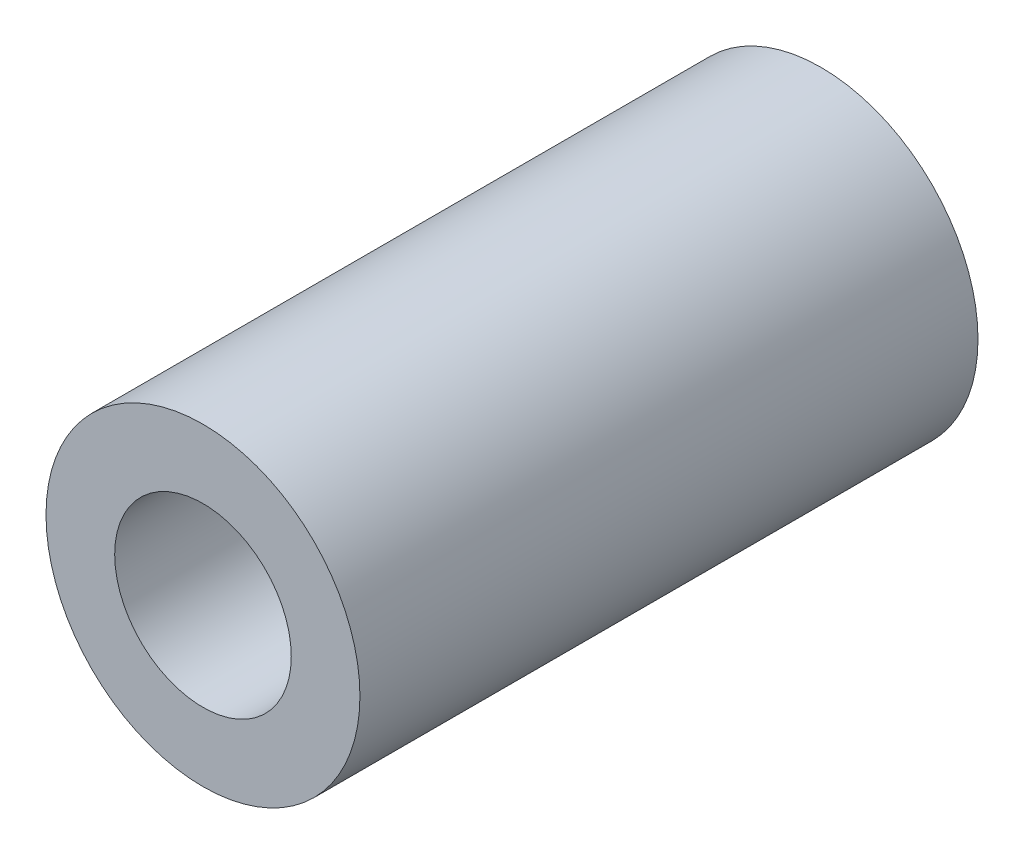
ISO-10303-21;
HEADER;
FILE_DESCRIPTION(('STEP AP214'),'2;1');
FILE_NAME('part.step','',(''),(''),'','','');
FILE_SCHEMA(('AUTOMOTIVE_DESIGN { 1 0 10303 214 1 1 1 1 }'));
ENDSEC;
DATA;
#1=APPLICATION_CONTEXT('core data for automotive mechanical design processes');
#2=APPLICATION_PROTOCOL_DEFINITION('international standard','automotive_design',2000,#1);
#3=PRODUCT_CONTEXT('',#1,'mechanical');
#4=PRODUCT('Part','Part','',(#3));
#5=PRODUCT_RELATED_PRODUCT_CATEGORY('part','',(#4));
#6=PRODUCT_DEFINITION_FORMATION('','',#4);
#7=PRODUCT_DEFINITION_CONTEXT('part definition',#1,'design');
#8=PRODUCT_DEFINITION('design','',#6,#7);
#9=PRODUCT_DEFINITION_SHAPE('','',#8);
#10=(LENGTH_UNIT() NAMED_UNIT(*) SI_UNIT(.MILLI.,.METRE.));
#11=(NAMED_UNIT(*) PLANE_ANGLE_UNIT() SI_UNIT($,.RADIAN.));
#12=(NAMED_UNIT(*) SI_UNIT($,.STERADIAN.) SOLID_ANGLE_UNIT());
#13=UNCERTAINTY_MEASURE_WITH_UNIT(LENGTH_MEASURE(1.E-05),#10,'distance_accuracy_value','');
#14=(GEOMETRIC_REPRESENTATION_CONTEXT(3) GLOBAL_UNCERTAINTY_ASSIGNED_CONTEXT((#13)) GLOBAL_UNIT_ASSIGNED_CONTEXT((#10,
#11,#12)) REPRESENTATION_CONTEXT('',''));
#15=CARTESIAN_POINT('',(0.,0.,0.));
#16=DIRECTION('',(0.,0.,1.));
#17=DIRECTION('',(1.,0.,0.));
#18=AXIS2_PLACEMENT_3D('',#15,#16,#17);
#19=CARTESIAN_POINT('',(9.,0.,9.));
#20=DIRECTION('',(0.,0.,-1.));
#21=DIRECTION('',(-1.,0.,0.));
#22=AXIS2_PLACEMENT_3D('',#19,#20,#21);
#23=PLANE('',#22);
#24=CARTESIAN_POINT('',(0.,0.,9.));
#25=DIRECTION('',(0.,0.,1.));
#26=DIRECTION('',(1.,0.,0.));
#27=AXIS2_PLACEMENT_3D('',#24,#25,#26);
#28=CIRCLE('',#27,5.5);
#29=CARTESIAN_POINT('',(5.5,0.,9.));
#30=VERTEX_POINT('',#29);
#31=EDGE_CURVE('E8',#30,#30,#28,.T.);
#32=ORIENTED_EDGE('',*,*,#31,.F.);
#33=EDGE_LOOP('',(#32));
#34=FACE_BOUND('',#33,.T.);
#35=CARTESIAN_POINT('',(0.,0.,9.));
#36=DIRECTION('',(0.,0.,1.));
#37=DIRECTION('',(1.,0.,0.));
#38=AXIS2_PLACEMENT_3D('',#35,#36,#37);
#39=CIRCLE('',#38,9.);
#40=CARTESIAN_POINT('',(9.,0.,9.));
#41=VERTEX_POINT('',#40);
#42=EDGE_CURVE('E34',#41,#41,#39,.T.);
#43=ORIENTED_EDGE('',*,*,#42,.T.);
#44=EDGE_LOOP('',(#43));
#45=FACE_BOUND('',#44,.T.);
#46=ADVANCED_FACE('F12',(#34,#45),#23,.F.);
#47=CARTESIAN_POINT('',(0.,0.,40.));
#48=DIRECTION('',(0.,0.,1.));
#49=DIRECTION('',(1.,0.,0.));
#50=AXIS2_PLACEMENT_3D('',#47,#48,#49);
#51=CYLINDRICAL_SURFACE('',#50,5.5);
#52=CARTESIAN_POINT('',(0.,0.,0.));
#53=DIRECTION('',(0.,0.,1.));
#54=DIRECTION('',(1.,0.,0.));
#55=AXIS2_PLACEMENT_3D('',#52,#53,#54);
#56=CIRCLE('',#55,5.5);
#57=CARTESIAN_POINT('',(5.5,0.,0.));
#58=VERTEX_POINT('',#57);
#59=EDGE_CURVE('E18',#58,#58,#56,.T.);
#60=ORIENTED_EDGE('',*,*,#59,.F.);
#61=EDGE_LOOP('',(#60));
#62=FACE_BOUND('',#61,.T.);
#63=ORIENTED_EDGE('',*,*,#31,.T.);
#64=EDGE_LOOP('',(#63));
#65=FACE_BOUND('',#64,.T.);
#66=ADVANCED_FACE('F59',(#62,#65),#51,.F.);
#67=CARTESIAN_POINT('',(5.5,0.,0.));
#68=DIRECTION('',(0.,0.,1.));
#69=DIRECTION('',(1.,0.,0.));
#70=AXIS2_PLACEMENT_3D('',#67,#68,#69);
#71=PLANE('',#70);
#72=CARTESIAN_POINT('',(0.,0.,0.));
#73=DIRECTION('',(0.,0.,1.));
#74=DIRECTION('',(1.,0.,0.));
#75=AXIS2_PLACEMENT_3D('',#72,#73,#74);
#76=CIRCLE('',#75,16.);
#77=CARTESIAN_POINT('',(16.,0.,0.));
#78=VERTEX_POINT('',#77);
#79=EDGE_CURVE('E22',#78,#78,#76,.T.);
#80=ORIENTED_EDGE('',*,*,#79,.F.);
#81=EDGE_LOOP('',(#80));
#82=FACE_BOUND('',#81,.T.);
#83=ORIENTED_EDGE('',*,*,#59,.T.);
#84=EDGE_LOOP('',(#83));
#85=FACE_BOUND('',#84,.T.);
#86=ADVANCED_FACE('F54',(#82,#85),#71,.F.);
#87=CARTESIAN_POINT('',(0.,0.,40.));
#88=DIRECTION('',(0.,0.,1.));
#89=DIRECTION('',(1.,0.,0.));
#90=AXIS2_PLACEMENT_3D('',#87,#88,#89);
#91=CYLINDRICAL_SURFACE('',#90,16.);
#92=CARTESIAN_POINT('',(0.,0.,63.));
#93=DIRECTION('',(0.,0.,1.));
#94=DIRECTION('',(1.,0.,0.));
#95=AXIS2_PLACEMENT_3D('',#92,#93,#94);
#96=CIRCLE('',#95,16.);
#97=CARTESIAN_POINT('',(16.,0.,63.));
#98=VERTEX_POINT('',#97);
#99=EDGE_CURVE('E26',#98,#98,#96,.T.);
#100=ORIENTED_EDGE('',*,*,#99,.F.);
#101=EDGE_LOOP('',(#100));
#102=FACE_BOUND('',#101,.T.);
#103=ORIENTED_EDGE('',*,*,#79,.T.);
#104=EDGE_LOOP('',(#103));
#105=FACE_BOUND('',#104,.T.);
#106=ADVANCED_FACE('F48',(#102,#105),#91,.T.);
#107=CARTESIAN_POINT('',(16.,0.,63.));
#108=DIRECTION('',(0.,0.,-1.));
#109=DIRECTION('',(-1.,0.,0.));
#110=AXIS2_PLACEMENT_3D('',#107,#108,#109);
#111=PLANE('',#110);
#112=CARTESIAN_POINT('',(0.,0.,63.));
#113=DIRECTION('',(0.,0.,1.));
#114=DIRECTION('',(1.,0.,0.));
#115=AXIS2_PLACEMENT_3D('',#112,#113,#114);
#116=CIRCLE('',#115,9.);
#117=CARTESIAN_POINT('',(9.,0.,63.));
#118=VERTEX_POINT('',#117);
#119=EDGE_CURVE('E31',#118,#118,#116,.T.);
#120=ORIENTED_EDGE('',*,*,#119,.F.);
#121=EDGE_LOOP('',(#120));
#122=FACE_BOUND('',#121,.T.);
#123=ORIENTED_EDGE('',*,*,#99,.T.);
#124=EDGE_LOOP('',(#123));
#125=FACE_BOUND('',#124,.T.);
#126=ADVANCED_FACE('F42',(#122,#125),#111,.F.);
#127=CARTESIAN_POINT('',(0.,0.,40.));
#128=DIRECTION('',(0.,0.,1.));
#129=DIRECTION('',(1.,0.,0.));
#130=AXIS2_PLACEMENT_3D('',#127,#128,#129);
#131=CYLINDRICAL_SURFACE('',#130,9.);
#132=ORIENTED_EDGE('',*,*,#42,.F.);
#133=EDGE_LOOP('',(#132));
#134=FACE_BOUND('',#133,.T.);
#135=ORIENTED_EDGE('',*,*,#119,.T.);
#136=EDGE_LOOP('',(#135));
#137=FACE_BOUND('',#136,.T.);
#138=ADVANCED_FACE('F39',(#134,#137),#131,.F.);
#139=CLOSED_SHELL('',(#46,#66,#86,#106,#126,#138));
#140=MANIFOLD_SOLID_BREP('B1',#139);
#141=ADVANCED_BREP_SHAPE_REPRESENTATION('',(#18,#140),#14);
#142=SHAPE_DEFINITION_REPRESENTATION(#9,#141);
ENDSEC;
END-ISO-10303-21;
